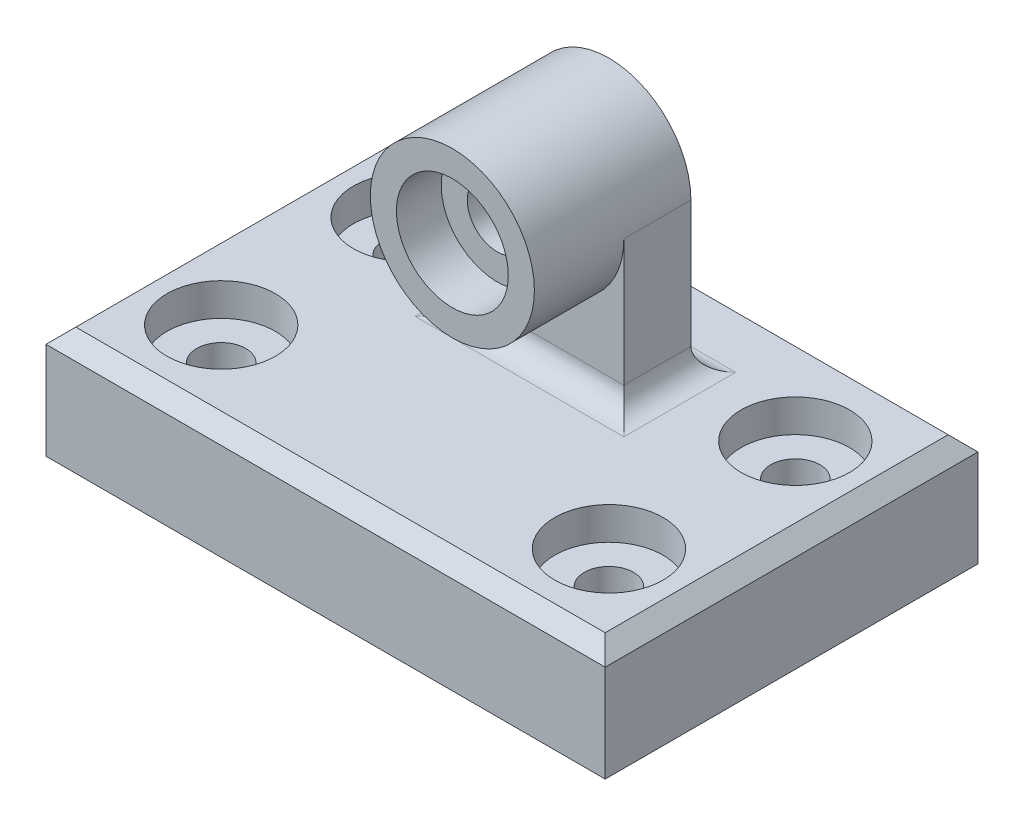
from build123d import *

# Parameters (mm, degrees)
SKETCH1_W                               = 75
SKETCH1_H                               = 50
BASE_DEPTH                              = 15
SKETCH3_W                               = 22
SKETCH3_H                               = 9
PILLAR_DEPTH                            = 35
SKETCH4_R                               = 11
BOSS_DEPTH                              = 21
BOSS_HOLE_REACH                         = 69.906
SKETCH5_R                               = 4
SKETCH6_R                               = 7.5
BOSS_COUNTERSINK_DEPTH                  = 6
CBORE_FOR_M6_HEX_HEAD_BOLT1_D           = 6.6
CBORE_FOR_M6_HEX_HEAD_BOLT1_CBORE_D     = 14.55
CBORE_FOR_M6_HEX_HEAD_BOLT1_CBORE_DEPTH = 4.38
CHAMFER1_SIZE                           = 2
FILLET2_R                               = 3
LPATTERN1_COUNT                         = 2
LPATTERN1_PITCH                         = 52
LPATTERN1_COUNT_DIR2                    = 2
LPATTERN1_PITCH_DIR2                    = 25


with BuildPart() as part:
    # Sketch1 → BASE (new body)
    with BuildSketch(Plane(origin=(0, 0, 0), x_dir=(1, 0, 0), z_dir=(0, 1, 0))):
        Rectangle(SKETCH1_W, SKETCH1_H)
    extrude(amount=BASE_DEPTH)

    # Sketch3 → PILLAR (add)
    with BuildSketch(Plane(origin=(0, 0, 0), x_dir=(1, 0, 0), z_dir=(0, 1, 0))):
        with Locations((0, 8.5)):
            Rectangle(SKETCH3_W, SKETCH3_H)
    extrude(amount=PILLAR_DEPTH)

    # Sketch4 → BOSS (add)
    with BuildSketch(Plane(origin=(0, 0, -13), x_dir=(-1, 0, 0), z_dir=(0, 0, -1))):
        with Locations((0, 35)):
            Circle(SKETCH4_R)
    extrude(amount=-BOSS_DEPTH)

    # Sketch5 → BOSS_HOLE (cut, up to next)
    with BuildSketch(Plane.XY.offset(8), mode=Mode.PRIVATE) as boss_hole_sk1:
        with Locations((0, 35)):
            Circle(SKETCH5_R)
    boss_hole_tool1 = extrude(boss_hole_sk1.sketch, amount=-BOSS_HOLE_REACH, mode=Mode.PRIVATE) & part.part
    add(boss_hole_tool1.solids().sort_by_distance((0, 35, 8))[0], mode=Mode.SUBTRACT)

    # Sketch6 → BOSS_CounterSink (cut)
    with BuildSketch(Plane.XY.offset(8)):
        with Locations((0, 35)):
            Circle(SKETCH6_R)
    extrude(amount=-BOSS_COUNTERSINK_DEPTH, mode=Mode.SUBTRACT)

    # CBORE for M6 Hex Head Bolt1 (through all)
    with Locations(Plane(origin=(0, 15, 0), x_dir=(1, 0, 0), z_dir=(0, 1, 0))):
        with Locations((-26, -13)):
            cbore_for_m6_hex_head_bolt1 = CounterBoreHole(CBORE_FOR_M6_HEX_HEAD_BOLT1_D / 2, CBORE_FOR_M6_HEX_HEAD_BOLT1_CBORE_D / 2, CBORE_FOR_M6_HEX_HEAD_BOLT1_CBORE_DEPTH)

    # Chamfer1
    chamfer1_edges = [part.edges().sort_by_distance(p)[0] for p in [
        (-37.5, 15, 0),
        (0, 15, 25),
        (37.5, 15, 0),
        (0, 15, -25),
    ]]
    chamfer(chamfer1_edges, length=CHAMFER1_SIZE)

    # Fillet2
    fillet2_edges = [part.edges().sort_by_distance(p)[0] for p in [
        (-11, 15, -8.5),
        (0, 15, -4),
        (11, 15, -8.5),
        (0, 15, -13),
    ]]
    fillet(fillet2_edges, radius=FILLET2_R)

    # LPattern1: CBORE for M6 Hex Head Bolt1 2 × 2
    with Locations(*[(i * LPATTERN1_PITCH, 0, -j * LPATTERN1_PITCH_DIR2) for i in range(LPATTERN1_COUNT) for j in range(LPATTERN1_COUNT_DIR2) if (i, j) != (0, 0)]):
        add(cbore_for_m6_hex_head_bolt1, mode=Mode.SUBTRACT)


solid = part.part
